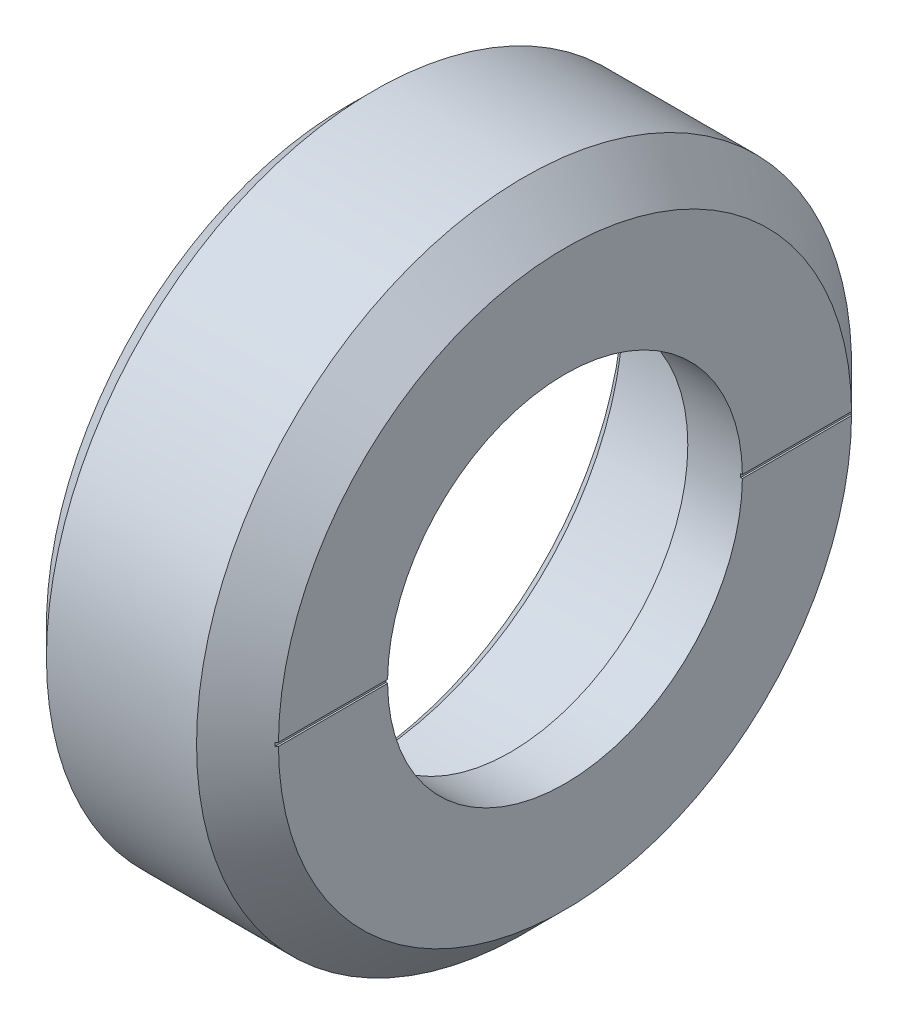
from build123d import *

# Parameters (mm, degrees)
CHANFREIN3_SIZE         = 1
CHANFREIN1_SIZE         = 3
CHANFREIN2_SIZE         = 2
ESQUISSE2_W             = 2.125
ESQUISSE2_H             = 0.25
ENL_V_MAT_EXTRU_1_DEPTH = 41.5


with BuildPart() as part:
    # Esquisse1 → Base-R_volution (revolve)
    with BuildSketch(Plane.XY, mode=Mode.PRIVATE) as base_r_volution_sk:
        Polygon((0, 19.25), (0, 24), (16, 24), (16, 13), (12, 13), (12, 20.25), (11, 20.25), (11, 19.25), align=None)
    revolve(base_r_volution_sk.sketch.rotate(Axis((0, 0, 0), (1, 0, 0)), 90), axis=Axis((0, 0, 0), (1, 0, 0)))

    # Chanfrein3
    chanfrein3_edges = [part.edges().sort_by_distance(p)[0] for p in [
        (0, 0, -19.25),
    ]]
    chamfer(chanfrein3_edges, length=CHANFREIN3_SIZE)

    # Chanfrein1
    chanfrein1_edges = [part.edges().sort_by_distance(p)[0] for p in [
        (16, 0, -24),
    ]]
    chamfer(chanfrein1_edges, length=CHANFREIN1_SIZE)

    # Chanfrein2
    chanfrein2_edges = [part.edges().sort_by_distance(p)[0] for p in [
        (0, 0, -24),
    ]]
    chamfer(chanfrein2_edges, length=CHANFREIN2_SIZE)

    # Esquisse2 → Enl_v. mat.-Extru.1 (cut, symmetric)
    with BuildSketch(Plane.XY):
        with Locations((16.9375, 0)):
            Rectangle(ESQUISSE2_W, ESQUISSE2_H)
    extrude(amount=ENL_V_MAT_EXTRU_1_DEPTH, both=True, mode=Mode.SUBTRACT)


solid = part.part
